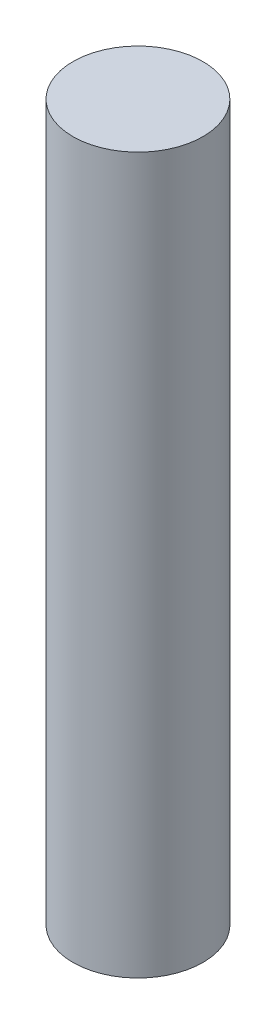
ISO-10303-21;
HEADER;
FILE_DESCRIPTION(('STEP AP214'),'2;1');
FILE_NAME('part.step','',(''),(''),'','','');
FILE_SCHEMA(('AUTOMOTIVE_DESIGN { 1 0 10303 214 1 1 1 1 }'));
ENDSEC;
DATA;
#1=APPLICATION_CONTEXT('core data for automotive mechanical design processes');
#2=APPLICATION_PROTOCOL_DEFINITION('international standard','automotive_design',2000,#1);
#3=PRODUCT_CONTEXT('',#1,'mechanical');
#4=PRODUCT('Part','Part','',(#3));
#5=PRODUCT_RELATED_PRODUCT_CATEGORY('part','',(#4));
#6=PRODUCT_DEFINITION_FORMATION('','',#4);
#7=PRODUCT_DEFINITION_CONTEXT('part definition',#1,'design');
#8=PRODUCT_DEFINITION('design','',#6,#7);
#9=PRODUCT_DEFINITION_SHAPE('','',#8);
#10=(LENGTH_UNIT() NAMED_UNIT(*) SI_UNIT(.MILLI.,.METRE.));
#11=(NAMED_UNIT(*) PLANE_ANGLE_UNIT() SI_UNIT($,.RADIAN.));
#12=(NAMED_UNIT(*) SI_UNIT($,.STERADIAN.) SOLID_ANGLE_UNIT());
#13=UNCERTAINTY_MEASURE_WITH_UNIT(LENGTH_MEASURE(1.E-05),#10,'distance_accuracy_value','');
#14=(GEOMETRIC_REPRESENTATION_CONTEXT(3) GLOBAL_UNCERTAINTY_ASSIGNED_CONTEXT((#13)) GLOBAL_UNIT_ASSIGNED_CONTEXT((#10,
#11,#12)) REPRESENTATION_CONTEXT('',''));
#15=CARTESIAN_POINT('',(0.,0.,0.));
#16=DIRECTION('',(0.,0.,1.));
#17=DIRECTION('',(1.,0.,0.));
#18=AXIS2_PLACEMENT_3D('',#15,#16,#17);
#19=CARTESIAN_POINT('',(1.,0.,0.));
#20=DIRECTION('',(-1.,0.,0.));
#21=DIRECTION('',(0.,0.,1.));
#22=AXIS2_PLACEMENT_3D('',#19,#20,#21);
#23=PLANE('',#22);
#24=DIRECTION('',(0.,1.,0.));
#25=VECTOR('',#24,1.);
#26=CARTESIAN_POINT('',(1.,7.50000000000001,-0.5));
#27=LINE('',#26,#25);
#28=CARTESIAN_POINT('',(1.,9.00000000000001,-0.5));
#29=VERTEX_POINT('',#28);
#30=CARTESIAN_POINT('',(1.,10.5,-0.5));
#31=VERTEX_POINT('',#30);
#32=EDGE_CURVE('E98',#29,#31,#27,.T.);
#33=ORIENTED_EDGE('',*,*,#32,.F.);
#34=DIRECTION('',(0.,0.,1.));
#35=VECTOR('',#34,1.);
#36=CARTESIAN_POINT('',(1.,9.00000000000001,0.));
#37=LINE('',#36,#35);
#38=CARTESIAN_POINT('',(1.,9.00000000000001,0.5));
#39=VERTEX_POINT('',#38);
#40=EDGE_CURVE('E11',#29,#39,#37,.T.);
#41=ORIENTED_EDGE('',*,*,#40,.T.);
#42=DIRECTION('',(0.,1.,0.));
#43=VECTOR('',#42,1.);
#44=CARTESIAN_POINT('',(1.,7.50000000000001,0.5));
#45=LINE('',#44,#43);
#46=CARTESIAN_POINT('',(1.,10.5,0.5));
#47=VERTEX_POINT('',#46);
#48=EDGE_CURVE('E118',#39,#47,#45,.T.);
#49=ORIENTED_EDGE('',*,*,#48,.T.);
#50=DIRECTION('',(0.,0.,1.));
#51=VECTOR('',#50,1.);
#52=CARTESIAN_POINT('',(1.,10.5,-0.5));
#53=LINE('',#52,#51);
#54=EDGE_CURVE('E120',#31,#47,#53,.T.);
#55=ORIENTED_EDGE('',*,*,#54,.F.);
#56=EDGE_LOOP('',(#33,#41,#49,#55));
#57=FACE_BOUND('',#56,.T.);
#58=ADVANCED_FACE('F37',(#57),#23,.T.);
#59=CARTESIAN_POINT('',(1.5,16.5,0.));
#60=DIRECTION('',(0.,-1.,0.));
#61=DIRECTION('',(0.,0.,-1.));
#62=AXIS2_PLACEMENT_3D('',#59,#60,#61);
#63=CYLINDRICAL_SURFACE('',#62,1.5);
#64=CARTESIAN_POINT('',(1.5,0.,0.));
#65=DIRECTION('',(0.,1.,0.));
#66=DIRECTION('',(0.,0.,1.));
#67=AXIS2_PLACEMENT_3D('',#64,#65,#66);
#68=CIRCLE('',#67,1.5);
#69=CARTESIAN_POINT('',(1.5,0.,1.5));
#70=VERTEX_POINT('',#69);
#71=EDGE_CURVE('E126',#70,#70,#68,.T.);
#72=ORIENTED_EDGE('',*,*,#71,.T.);
#73=EDGE_LOOP('',(#72));
#74=FACE_BOUND('',#73,.T.);
#75=CARTESIAN_POINT('',(1.5,16.5,0.));
#76=DIRECTION('',(0.,1.,0.));
#77=DIRECTION('',(0.,0.,1.));
#78=AXIS2_PLACEMENT_3D('',#75,#76,#77);
#79=CIRCLE('',#78,1.5);
#80=CARTESIAN_POINT('',(1.5,16.5,1.5));
#81=VERTEX_POINT('',#80);
#82=EDGE_CURVE('E132',#81,#81,#79,.T.);
#83=ORIENTED_EDGE('',*,*,#82,.F.);
#84=EDGE_LOOP('',(#83));
#85=FACE_BOUND('',#84,.T.);
#86=CARTESIAN_POINT('',(1.5,10.5,0.));
#87=DIRECTION('',(0.,-1.,0.));
#88=DIRECTION('',(0.,0.,-1.));
#89=AXIS2_PLACEMENT_3D('',#86,#87,#88);
#90=CIRCLE('',#89,1.5);
#91=CARTESIAN_POINT('',(0.0857864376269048,10.5,0.5));
#92=VERTEX_POINT('',#91);
#93=CARTESIAN_POINT('',(0.0857864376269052,10.5,-0.5));
#94=VERTEX_POINT('',#93);
#95=EDGE_CURVE('E135',#92,#94,#90,.T.);
#96=ORIENTED_EDGE('',*,*,#95,.F.);
#97=DIRECTION('',(0.,-1.,0.));
#98=VECTOR('',#97,1.);
#99=CARTESIAN_POINT('',(0.0857864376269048,16.5,0.5));
#100=LINE('',#99,#98);
#101=CARTESIAN_POINT('',(0.0857864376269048,7.50000000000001,0.5));
#102=VERTEX_POINT('',#101);
#103=EDGE_CURVE('E45',#92,#102,#100,.T.);
#104=ORIENTED_EDGE('',*,*,#103,.T.);
#105=CARTESIAN_POINT('',(1.5,7.50000000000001,0.));
#106=DIRECTION('',(0.,-1.,0.));
#107=DIRECTION('',(0.,0.,-1.));
#108=AXIS2_PLACEMENT_3D('',#105,#106,#107);
#109=CIRCLE('',#108,1.5);
#110=CARTESIAN_POINT('',(0.0857864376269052,7.50000000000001,-0.5));
#111=VERTEX_POINT('',#110);
#112=EDGE_CURVE('E94',#102,#111,#109,.T.);
#113=ORIENTED_EDGE('',*,*,#112,.T.);
#114=DIRECTION('',(0.,-1.,0.));
#115=VECTOR('',#114,1.);
#116=CARTESIAN_POINT('',(0.0857864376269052,16.5,-0.5));
#117=LINE('',#116,#115);
#118=EDGE_CURVE('E139',#94,#111,#117,.T.);
#119=ORIENTED_EDGE('',*,*,#118,.F.);
#120=EDGE_LOOP('',(#96,#104,#113,#119));
#121=FACE_BOUND('',#120,.T.);
#122=ADVANCED_FACE('F39',(#74,#85,#121),#63,.T.);
#123=CARTESIAN_POINT('',(1.5,16.5,0.));
#124=DIRECTION('',(0.,1.,0.));
#125=DIRECTION('',(0.,0.,1.));
#126=AXIS2_PLACEMENT_3D('',#123,#124,#125);
#127=PLANE('',#126);
#128=ORIENTED_EDGE('',*,*,#82,.T.);
#129=EDGE_LOOP('',(#128));
#130=FACE_BOUND('',#129,.T.);
#131=ADVANCED_FACE('F167',(#130),#127,.T.);
#132=CARTESIAN_POINT('',(1.5,0.,0.));
#133=DIRECTION('',(0.,1.,0.));
#134=DIRECTION('',(0.,0.,1.));
#135=AXIS2_PLACEMENT_3D('',#132,#133,#134);
#136=PLANE('',#135);
#137=ORIENTED_EDGE('',*,*,#71,.F.);
#138=EDGE_LOOP('',(#137));
#139=FACE_BOUND('',#138,.T.);
#140=ADVANCED_FACE('F176',(#139),#136,.F.);
#141=CARTESIAN_POINT('',(1.,7.50000000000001,-0.5));
#142=DIRECTION('',(0.,-1.,0.));
#143=DIRECTION('',(0.,0.,-1.));
#144=AXIS2_PLACEMENT_3D('',#141,#142,#143);
#145=PLANE('',#144);
#146=DIRECTION('',(-1.,0.,0.));
#147=VECTOR('',#146,1.);
#148=CARTESIAN_POINT('',(1.,7.50000000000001,0.5));
#149=LINE('',#148,#147);
#150=CARTESIAN_POINT('',(1.5,7.50000000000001,0.5));
#151=VERTEX_POINT('',#150);
#152=EDGE_CURVE('E88',#151,#102,#149,.T.);
#153=ORIENTED_EDGE('',*,*,#152,.F.);
#154=DIRECTION('',(0.,0.,-1.));
#155=VECTOR('',#154,1.);
#156=CARTESIAN_POINT('',(1.5,7.50000000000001,-0.5));
#157=LINE('',#156,#155);
#158=CARTESIAN_POINT('',(1.5,7.50000000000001,-0.5));
#159=VERTEX_POINT('',#158);
#160=EDGE_CURVE('E92',#151,#159,#157,.T.);
#161=ORIENTED_EDGE('',*,*,#160,.T.);
#162=DIRECTION('',(-1.,0.,0.));
#163=VECTOR('',#162,1.);
#164=CARTESIAN_POINT('',(1.,7.50000000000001,-0.5));
#165=LINE('',#164,#163);
#166=EDGE_CURVE('E124',#159,#111,#165,.T.);
#167=ORIENTED_EDGE('',*,*,#166,.T.);
#168=ORIENTED_EDGE('',*,*,#112,.F.);
#169=EDGE_LOOP('',(#153,#161,#167,#168));
#170=FACE_BOUND('',#169,.T.);
#171=ADVANCED_FACE('F90',(#170),#145,.F.);
#172=CARTESIAN_POINT('',(1.,7.50000000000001,-0.5));
#173=DIRECTION('',(0.,0.,1.));
#174=DIRECTION('',(1.,0.,0.));
#175=AXIS2_PLACEMENT_3D('',#172,#173,#174);
#176=PLANE('',#175);
#177=DIRECTION('',(-1.,0.,0.));
#178=VECTOR('',#177,1.);
#179=CARTESIAN_POINT('',(1.5,9.00000000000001,-0.5));
#180=LINE('',#179,#178);
#181=CARTESIAN_POINT('',(1.5,9.00000000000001,-0.5));
#182=VERTEX_POINT('',#181);
#183=EDGE_CURVE('E115',#182,#29,#180,.T.);
#184=ORIENTED_EDGE('',*,*,#183,.T.);
#185=ORIENTED_EDGE('',*,*,#32,.T.);
#186=DIRECTION('',(-1.,0.,0.));
#187=VECTOR('',#186,1.);
#188=CARTESIAN_POINT('',(1.,10.5,-0.5));
#189=LINE('',#188,#187);
#190=EDGE_CURVE('E127',#31,#94,#189,.T.);
#191=ORIENTED_EDGE('',*,*,#190,.T.);
#192=ORIENTED_EDGE('',*,*,#118,.T.);
#193=ORIENTED_EDGE('',*,*,#166,.F.);
#194=DIRECTION('',(0.,1.,0.));
#195=VECTOR('',#194,1.);
#196=CARTESIAN_POINT('',(1.5,7.50000000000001,-0.5));
#197=LINE('',#196,#195);
#198=EDGE_CURVE('E105',#159,#182,#197,.T.);
#199=ORIENTED_EDGE('',*,*,#198,.T.);
#200=EDGE_LOOP('',(#184,#185,#191,#192,#193,#199));
#201=FACE_BOUND('',#200,.T.);
#202=ADVANCED_FACE('F144',(#201),#176,.T.);
#203=CARTESIAN_POINT('',(1.,10.5,-0.5));
#204=DIRECTION('',(0.,-1.,0.));
#205=DIRECTION('',(0.,0.,-1.));
#206=AXIS2_PLACEMENT_3D('',#203,#204,#205);
#207=PLANE('',#206);
#208=DIRECTION('',(-1.,0.,0.));
#209=VECTOR('',#208,1.);
#210=CARTESIAN_POINT('',(1.,10.5,0.5));
#211=LINE('',#210,#209);
#212=EDGE_CURVE('E97',#47,#92,#211,.T.);
#213=ORIENTED_EDGE('',*,*,#212,.T.);
#214=ORIENTED_EDGE('',*,*,#95,.T.);
#215=ORIENTED_EDGE('',*,*,#190,.F.);
#216=ORIENTED_EDGE('',*,*,#54,.T.);
#217=EDGE_LOOP('',(#213,#214,#215,#216));
#218=FACE_BOUND('',#217,.T.);
#219=ADVANCED_FACE('F149',(#218),#207,.T.);
#220=CARTESIAN_POINT('',(1.,7.50000000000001,0.5));
#221=DIRECTION('',(0.,0.,1.));
#222=DIRECTION('',(1.,0.,0.));
#223=AXIS2_PLACEMENT_3D('',#220,#221,#222);
#224=PLANE('',#223);
#225=ORIENTED_EDGE('',*,*,#152,.T.);
#226=ORIENTED_EDGE('',*,*,#103,.F.);
#227=ORIENTED_EDGE('',*,*,#212,.F.);
#228=ORIENTED_EDGE('',*,*,#48,.F.);
#229=DIRECTION('',(-1.,0.,0.));
#230=VECTOR('',#229,1.);
#231=CARTESIAN_POINT('',(1.5,9.00000000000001,0.5));
#232=LINE('',#231,#230);
#233=CARTESIAN_POINT('',(1.5,9.00000000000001,0.5));
#234=VERTEX_POINT('',#233);
#235=EDGE_CURVE('E52',#234,#39,#232,.T.);
#236=ORIENTED_EDGE('',*,*,#235,.F.);
#237=DIRECTION('',(0.,-1.,0.));
#238=VECTOR('',#237,1.);
#239=CARTESIAN_POINT('',(1.5,7.50000000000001,0.5));
#240=LINE('',#239,#238);
#241=EDGE_CURVE('E104',#234,#151,#240,.T.);
#242=ORIENTED_EDGE('',*,*,#241,.T.);
#243=EDGE_LOOP('',(#225,#226,#227,#228,#236,#242));
#244=FACE_BOUND('',#243,.T.);
#245=ADVANCED_FACE('F107',(#244),#224,.F.);
#246=CARTESIAN_POINT('',(1.5,9.00000000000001,-0.5));
#247=DIRECTION('',(0.,-1.,0.));
#248=DIRECTION('',(0.,0.,-1.));
#249=AXIS2_PLACEMENT_3D('',#246,#247,#248);
#250=PLANE('',#249);
#251=ORIENTED_EDGE('',*,*,#183,.F.);
#252=DIRECTION('',(0.,0.,1.));
#253=VECTOR('',#252,1.);
#254=CARTESIAN_POINT('',(1.5,9.00000000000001,-0.5));
#255=LINE('',#254,#253);
#256=EDGE_CURVE('E112',#182,#234,#255,.T.);
#257=ORIENTED_EDGE('',*,*,#256,.T.);
#258=ORIENTED_EDGE('',*,*,#235,.T.);
#259=ORIENTED_EDGE('',*,*,#40,.F.);
#260=EDGE_LOOP('',(#251,#257,#258,#259));
#261=FACE_BOUND('',#260,.T.);
#262=ADVANCED_FACE('F153',(#261),#250,.T.);
#263=CARTESIAN_POINT('',(1.5,0.,0.));
#264=DIRECTION('',(1.,0.,0.));
#265=DIRECTION('',(0.,0.,-1.));
#266=AXIS2_PLACEMENT_3D('',#263,#264,#265);
#267=PLANE('',#266);
#268=ORIENTED_EDGE('',*,*,#241,.F.);
#269=ORIENTED_EDGE('',*,*,#256,.F.);
#270=ORIENTED_EDGE('',*,*,#198,.F.);
#271=ORIENTED_EDGE('',*,*,#160,.F.);
#272=EDGE_LOOP('',(#268,#269,#270,#271));
#273=FACE_BOUND('',#272,.T.);
#274=ADVANCED_FACE('F102',(#273),#267,.F.);
#275=CLOSED_SHELL('',(#58,#122,#131,#140,#171,#202,#219,#245,#262,#274));
#276=MANIFOLD_SOLID_BREP('B2',#275);
#277=ADVANCED_BREP_SHAPE_REPRESENTATION('',(#18,#276),#14);
#278=SHAPE_DEFINITION_REPRESENTATION(#9,#277);
ENDSEC;
END-ISO-10303-21;
